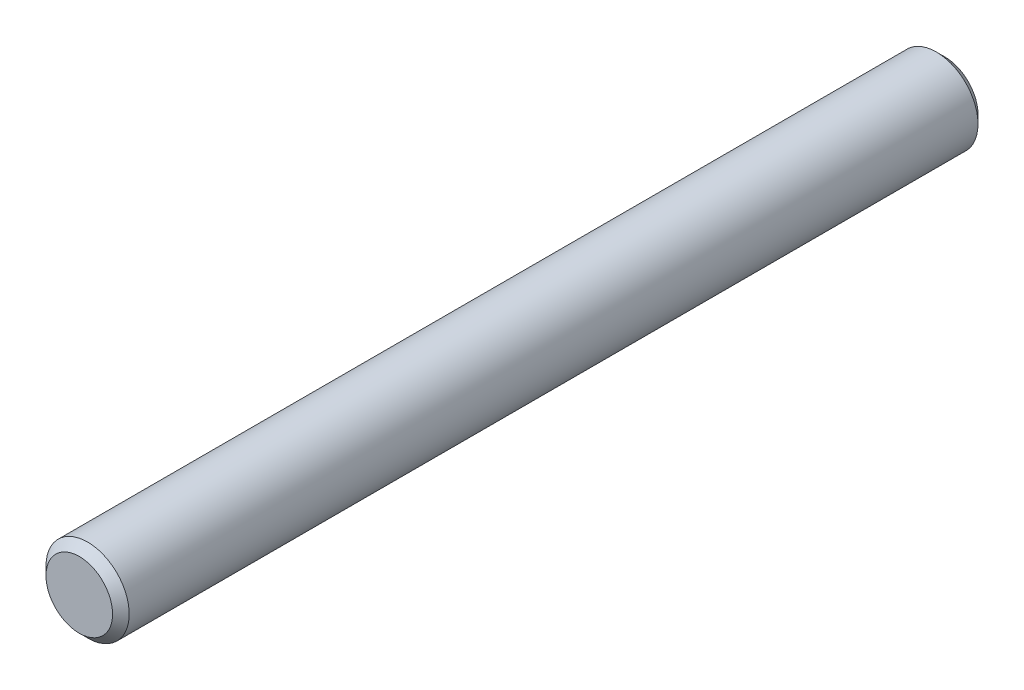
from build123d import *

# Parameters (mm, degrees)
ESQUISSE2_R        = 2.5
BOSS_EXTRU_1_DEPTH = 52
CHANFREIN1_SIZE    = 0.5


with BuildPart() as part:
    # Esquisse2 → Boss.-Extru.1 (new body)
    with BuildSketch(Plane.XY):
        with Locations(Location((0, 0, 0), (0, 0, 180))):
            Circle(ESQUISSE2_R)
    extrude(amount=BOSS_EXTRU_1_DEPTH)

    # Chanfrein1
    chanfrein1_edges = [part.edges().sort_by_distance(p)[0] for p in [
        (2.5, 0, 0),
        (2.5, 0, 52),
    ]]
    chamfer(chanfrein1_edges, length=CHANFREIN1_SIZE)


solid = part.part
